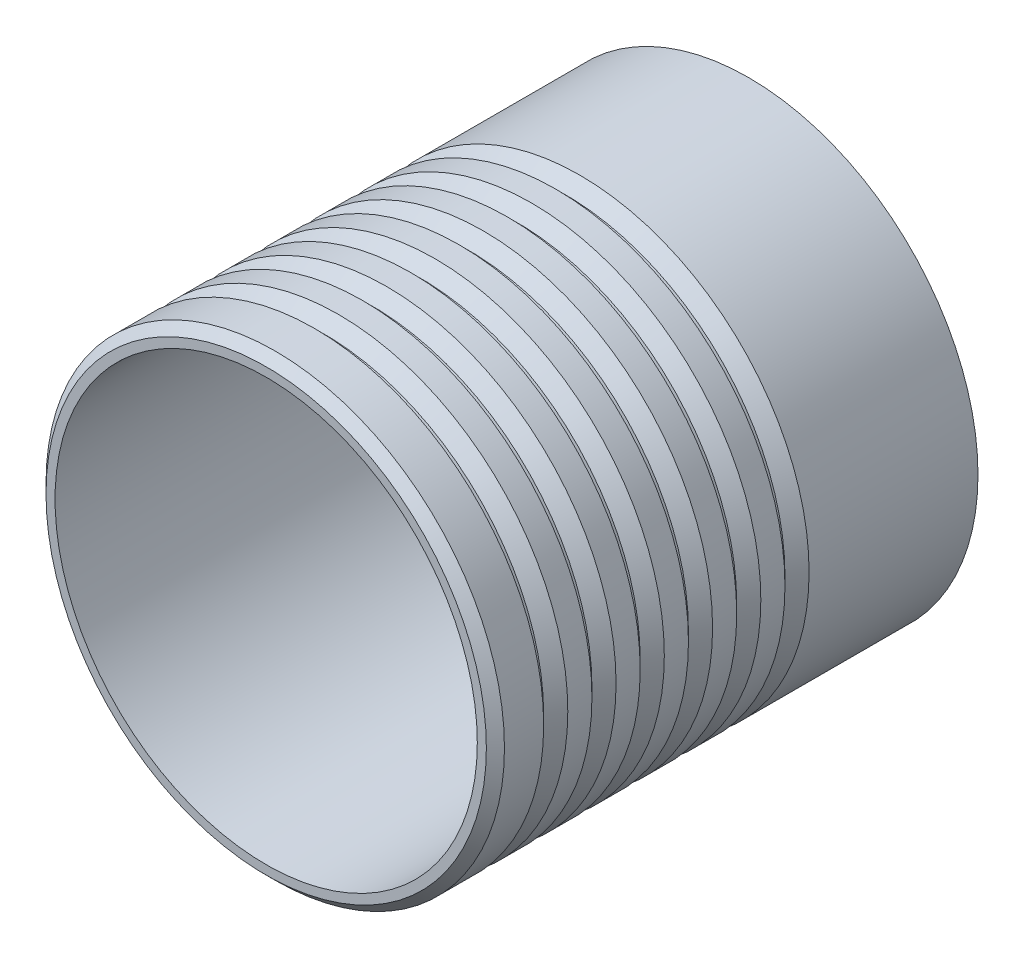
ISO-10303-21;
HEADER;
FILE_DESCRIPTION(('STEP AP214'),'2;1');
FILE_NAME('part.step','',(''),(''),'','','');
FILE_SCHEMA(('AUTOMOTIVE_DESIGN { 1 0 10303 214 1 1 1 1 }'));
ENDSEC;
DATA;
#1=APPLICATION_CONTEXT('core data for automotive mechanical design processes');
#2=APPLICATION_PROTOCOL_DEFINITION('international standard','automotive_design',2000,#1);
#3=PRODUCT_CONTEXT('',#1,'mechanical');
#4=PRODUCT('Part','Part','',(#3));
#5=PRODUCT_RELATED_PRODUCT_CATEGORY('part','',(#4));
#6=PRODUCT_DEFINITION_FORMATION('','',#4);
#7=PRODUCT_DEFINITION_CONTEXT('part definition',#1,'design');
#8=PRODUCT_DEFINITION('design','',#6,#7);
#9=PRODUCT_DEFINITION_SHAPE('','',#8);
#10=(LENGTH_UNIT() NAMED_UNIT(*) SI_UNIT(.MILLI.,.METRE.));
#11=(NAMED_UNIT(*) PLANE_ANGLE_UNIT() SI_UNIT($,.RADIAN.));
#12=(NAMED_UNIT(*) SI_UNIT($,.STERADIAN.) SOLID_ANGLE_UNIT());
#13=UNCERTAINTY_MEASURE_WITH_UNIT(LENGTH_MEASURE(1.E-05),#10,'distance_accuracy_value','');
#14=(GEOMETRIC_REPRESENTATION_CONTEXT(3) GLOBAL_UNCERTAINTY_ASSIGNED_CONTEXT((#13)) GLOBAL_UNIT_ASSIGNED_CONTEXT((#10,
#11,#12)) REPRESENTATION_CONTEXT('',''));
#15=CARTESIAN_POINT('',(0.,0.,0.));
#16=DIRECTION('',(0.,0.,1.));
#17=DIRECTION('',(1.,0.,0.));
#18=AXIS2_PLACEMENT_3D('',#15,#16,#17);
#19=CARTESIAN_POINT('',(0.,0.,80.));
#20=DIRECTION('',(0.,0.,-1.));
#21=DIRECTION('',(-1.,0.,0.));
#22=AXIS2_PLACEMENT_3D('',#19,#20,#21);
#23=CYLINDRICAL_SURFACE('',#22,38.);
#24=CARTESIAN_POINT('',(0.,0.,36.));
#25=DIRECTION('',(0.,0.,1.));
#26=DIRECTION('',(1.,0.,0.));
#27=AXIS2_PLACEMENT_3D('',#24,#25,#26);
#28=CIRCLE('',#27,38.);
#29=CARTESIAN_POINT('',(38.,0.,36.));
#30=VERTEX_POINT('',#29);
#31=EDGE_CURVE('E104',#30,#30,#28,.T.);
#32=ORIENTED_EDGE('',*,*,#31,.F.);
#33=EDGE_LOOP('',(#32));
#34=FACE_BOUND('',#33,.T.);
#35=CARTESIAN_POINT('',(0.,0.,32.));
#36=DIRECTION('',(0.,0.,1.));
#37=DIRECTION('',(1.,0.,0.));
#38=AXIS2_PLACEMENT_3D('',#35,#36,#37);
#39=CIRCLE('',#38,38.);
#40=CARTESIAN_POINT('',(38.,0.,32.));
#41=VERTEX_POINT('',#40);
#42=EDGE_CURVE('E113',#41,#41,#39,.T.);
#43=ORIENTED_EDGE('',*,*,#42,.T.);
#44=EDGE_LOOP('',(#43));
#45=FACE_BOUND('',#44,.T.);
#46=ADVANCED_FACE('F30',(#34,#45),#23,.T.);
#47=CARTESIAN_POINT('',(0.,0.,0.));
#48=DIRECTION('',(0.,0.,1.));
#49=DIRECTION('',(1.,0.,0.));
#50=AXIS2_PLACEMENT_3D('',#47,#48,#49);
#51=CIRCLE('',#50,38.);
#52=CARTESIAN_POINT('',(38.,0.,0.));
#53=VERTEX_POINT('',#52);
#54=EDGE_CURVE('E41',#53,#53,#51,.T.);
#55=ORIENTED_EDGE('',*,*,#54,.T.);
#56=EDGE_LOOP('',(#55));
#57=FACE_BOUND('',#56,.T.);
#58=CARTESIAN_POINT('',(0.,0.,28.));
#59=DIRECTION('',(0.,0.,1.));
#60=DIRECTION('',(1.,0.,0.));
#61=AXIS2_PLACEMENT_3D('',#58,#59,#60);
#62=CIRCLE('',#61,38.);
#63=CARTESIAN_POINT('',(38.,0.,28.));
#64=VERTEX_POINT('',#63);
#65=EDGE_CURVE('E116',#64,#64,#62,.T.);
#66=ORIENTED_EDGE('',*,*,#65,.F.);
#67=EDGE_LOOP('',(#66));
#68=FACE_BOUND('',#67,.T.);
#69=ADVANCED_FACE('F142',(#57,#68),#23,.T.);
#70=CARTESIAN_POINT('',(0.,0.,44.));
#71=DIRECTION('',(0.,0.,1.));
#72=DIRECTION('',(1.,0.,0.));
#73=AXIS2_PLACEMENT_3D('',#70,#71,#72);
#74=CIRCLE('',#73,38.);
#75=CARTESIAN_POINT('',(38.,0.,44.));
#76=VERTEX_POINT('',#75);
#77=EDGE_CURVE('E92',#76,#76,#74,.T.);
#78=ORIENTED_EDGE('',*,*,#77,.F.);
#79=EDGE_LOOP('',(#78));
#80=FACE_BOUND('',#79,.T.);
#81=CARTESIAN_POINT('',(0.,0.,40.));
#82=DIRECTION('',(0.,0.,1.));
#83=DIRECTION('',(1.,0.,0.));
#84=AXIS2_PLACEMENT_3D('',#81,#82,#83);
#85=CIRCLE('',#84,38.);
#86=CARTESIAN_POINT('',(38.,0.,40.));
#87=VERTEX_POINT('',#86);
#88=EDGE_CURVE('E101',#87,#87,#85,.T.);
#89=ORIENTED_EDGE('',*,*,#88,.T.);
#90=EDGE_LOOP('',(#89));
#91=FACE_BOUND('',#90,.T.);
#92=ADVANCED_FACE('F148',(#80,#91),#23,.T.);
#93=CARTESIAN_POINT('',(0.,0.,52.));
#94=DIRECTION('',(0.,0.,1.));
#95=DIRECTION('',(1.,0.,0.));
#96=AXIS2_PLACEMENT_3D('',#93,#94,#95);
#97=CIRCLE('',#96,38.);
#98=CARTESIAN_POINT('',(38.,0.,52.));
#99=VERTEX_POINT('',#98);
#100=EDGE_CURVE('E80',#99,#99,#97,.T.);
#101=ORIENTED_EDGE('',*,*,#100,.F.);
#102=EDGE_LOOP('',(#101));
#103=FACE_BOUND('',#102,.T.);
#104=CARTESIAN_POINT('',(0.,0.,48.));
#105=DIRECTION('',(0.,0.,1.));
#106=DIRECTION('',(1.,0.,0.));
#107=AXIS2_PLACEMENT_3D('',#104,#105,#106);
#108=CIRCLE('',#107,38.);
#109=CARTESIAN_POINT('',(38.,0.,48.));
#110=VERTEX_POINT('',#109);
#111=EDGE_CURVE('E89',#110,#110,#108,.T.);
#112=ORIENTED_EDGE('',*,*,#111,.T.);
#113=EDGE_LOOP('',(#112));
#114=FACE_BOUND('',#113,.T.);
#115=ADVANCED_FACE('F243',(#103,#114),#23,.T.);
#116=CARTESIAN_POINT('',(0.,0.,60.));
#117=DIRECTION('',(0.,0.,1.));
#118=DIRECTION('',(1.,0.,0.));
#119=AXIS2_PLACEMENT_3D('',#116,#117,#118);
#120=CIRCLE('',#119,38.);
#121=CARTESIAN_POINT('',(38.,0.,60.));
#122=VERTEX_POINT('',#121);
#123=EDGE_CURVE('E68',#122,#122,#120,.T.);
#124=ORIENTED_EDGE('',*,*,#123,.F.);
#125=EDGE_LOOP('',(#124));
#126=FACE_BOUND('',#125,.T.);
#127=CARTESIAN_POINT('',(0.,0.,56.));
#128=DIRECTION('',(0.,0.,1.));
#129=DIRECTION('',(1.,0.,0.));
#130=AXIS2_PLACEMENT_3D('',#127,#128,#129);
#131=CIRCLE('',#130,38.);
#132=CARTESIAN_POINT('',(38.,0.,56.));
#133=VERTEX_POINT('',#132);
#134=EDGE_CURVE('E77',#133,#133,#131,.T.);
#135=ORIENTED_EDGE('',*,*,#134,.T.);
#136=EDGE_LOOP('',(#135));
#137=FACE_BOUND('',#136,.T.);
#138=ADVANCED_FACE('F162',(#126,#137),#23,.T.);
#139=CARTESIAN_POINT('',(0.,0.,68.));
#140=DIRECTION('',(0.,0.,1.));
#141=DIRECTION('',(1.,0.,0.));
#142=AXIS2_PLACEMENT_3D('',#139,#140,#141);
#143=CIRCLE('',#142,38.);
#144=CARTESIAN_POINT('',(38.,0.,68.));
#145=VERTEX_POINT('',#144);
#146=EDGE_CURVE('E56',#145,#145,#143,.T.);
#147=ORIENTED_EDGE('',*,*,#146,.F.);
#148=EDGE_LOOP('',(#147));
#149=FACE_BOUND('',#148,.T.);
#150=CARTESIAN_POINT('',(0.,0.,64.));
#151=DIRECTION('',(0.,0.,1.));
#152=DIRECTION('',(1.,0.,0.));
#153=AXIS2_PLACEMENT_3D('',#150,#151,#152);
#154=CIRCLE('',#153,38.);
#155=CARTESIAN_POINT('',(38.,0.,64.));
#156=VERTEX_POINT('',#155);
#157=EDGE_CURVE('E65',#156,#156,#154,.T.);
#158=ORIENTED_EDGE('',*,*,#157,.T.);
#159=EDGE_LOOP('',(#158));
#160=FACE_BOUND('',#159,.T.);
#161=ADVANCED_FACE('F155',(#149,#160),#23,.T.);
#162=CARTESIAN_POINT('',(0.,0.,78.5));
#163=DIRECTION('',(0.,0.,1.));
#164=DIRECTION('',(1.,0.,0.));
#165=AXIS2_PLACEMENT_3D('',#162,#163,#164);
#166=CIRCLE('',#165,38.);
#167=CARTESIAN_POINT('',(38.,0.,78.5));
#168=VERTEX_POINT('',#167);
#169=EDGE_CURVE('E10',#168,#168,#166,.F.);
#170=ORIENTED_EDGE('',*,*,#169,.T.);
#171=EDGE_LOOP('',(#170));
#172=FACE_BOUND('',#171,.T.);
#173=CARTESIAN_POINT('',(0.,0.,72.));
#174=DIRECTION('',(0.,0.,1.));
#175=DIRECTION('',(1.,0.,0.));
#176=AXIS2_PLACEMENT_3D('',#173,#174,#175);
#177=CIRCLE('',#176,38.);
#178=CARTESIAN_POINT('',(38.,0.,72.));
#179=VERTEX_POINT('',#178);
#180=EDGE_CURVE('E51',#179,#179,#177,.T.);
#181=ORIENTED_EDGE('',*,*,#180,.T.);
#182=EDGE_LOOP('',(#181));
#183=FACE_BOUND('',#182,.T.);
#184=ADVANCED_FACE('F144',(#172,#183),#23,.T.);
#185=CARTESIAN_POINT('',(0.,0.,80.));
#186=DIRECTION('',(0.,0.,1.));
#187=DIRECTION('',(1.,0.,0.));
#188=AXIS2_PLACEMENT_3D('',#185,#186,#187);
#189=PLANE('',#188);
#190=CARTESIAN_POINT('',(0.,0.,80.));
#191=DIRECTION('',(0.,0.,1.));
#192=DIRECTION('',(1.,0.,0.));
#193=AXIS2_PLACEMENT_3D('',#190,#191,#192);
#194=CIRCLE('',#193,36.5);
#195=CARTESIAN_POINT('',(36.5,0.,80.));
#196=VERTEX_POINT('',#195);
#197=EDGE_CURVE('E37',#196,#196,#194,.T.);
#198=ORIENTED_EDGE('',*,*,#197,.T.);
#199=EDGE_LOOP('',(#198));
#200=FACE_BOUND('',#199,.T.);
#201=CARTESIAN_POINT('',(0.,0.,80.));
#202=DIRECTION('',(0.,0.,1.));
#203=DIRECTION('',(1.,0.,0.));
#204=AXIS2_PLACEMENT_3D('',#201,#202,#203);
#205=CIRCLE('',#204,35.);
#206=CARTESIAN_POINT('',(35.,0.,80.));
#207=VERTEX_POINT('',#206);
#208=EDGE_CURVE('E45',#207,#207,#205,.T.);
#209=ORIENTED_EDGE('',*,*,#208,.F.);
#210=EDGE_LOOP('',(#209));
#211=FACE_BOUND('',#210,.T.);
#212=ADVANCED_FACE('F154',(#200,#211),#189,.T.);
#213=CARTESIAN_POINT('',(0.,0.,0.));
#214=DIRECTION('',(0.,0.,1.));
#215=DIRECTION('',(1.,0.,0.));
#216=AXIS2_PLACEMENT_3D('',#213,#214,#215);
#217=PLANE('',#216);
#218=ORIENTED_EDGE('',*,*,#54,.F.);
#219=EDGE_LOOP('',(#218));
#220=FACE_BOUND('',#219,.T.);
#221=CARTESIAN_POINT('',(0.,0.,0.));
#222=DIRECTION('',(0.,0.,1.));
#223=DIRECTION('',(1.,0.,0.));
#224=AXIS2_PLACEMENT_3D('',#221,#222,#223);
#225=CIRCLE('',#224,35.);
#226=CARTESIAN_POINT('',(35.,0.,0.));
#227=VERTEX_POINT('',#226);
#228=EDGE_CURVE('E48',#227,#227,#225,.T.);
#229=ORIENTED_EDGE('',*,*,#228,.T.);
#230=EDGE_LOOP('',(#229));
#231=FACE_BOUND('',#230,.T.);
#232=ADVANCED_FACE('F160',(#220,#231),#217,.F.);
#233=CARTESIAN_POINT('',(0.,0.,80.));
#234=DIRECTION('',(0.,0.,-1.));
#235=DIRECTION('',(-1.,0.,0.));
#236=AXIS2_PLACEMENT_3D('',#233,#234,#235);
#237=CYLINDRICAL_SURFACE('',#236,35.);
#238=ORIENTED_EDGE('',*,*,#208,.T.);
#239=EDGE_LOOP('',(#238));
#240=FACE_BOUND('',#239,.T.);
#241=ORIENTED_EDGE('',*,*,#228,.F.);
#242=EDGE_LOOP('',(#241));
#243=FACE_BOUND('',#242,.T.);
#244=ADVANCED_FACE('F170',(#240,#243),#237,.F.);
#245=CARTESIAN_POINT('',(0.,36.5,72.));
#246=DIRECTION('',(0.,0.,-1.));
#247=DIRECTION('',(-1.,0.,0.));
#248=AXIS2_PLACEMENT_3D('',#245,#246,#247);
#249=PLANE('',#248);
#250=CARTESIAN_POINT('',(0.,0.,72.));
#251=DIRECTION('',(0.,0.,1.));
#252=DIRECTION('',(1.,0.,0.));
#253=AXIS2_PLACEMENT_3D('',#250,#251,#252);
#254=CIRCLE('',#253,36.5);
#255=CARTESIAN_POINT('',(36.5,0.,72.));
#256=VERTEX_POINT('',#255);
#257=EDGE_CURVE('E62',#256,#256,#254,.T.);
#258=ORIENTED_EDGE('',*,*,#257,.T.);
#259=EDGE_LOOP('',(#258));
#260=FACE_BOUND('',#259,.T.);
#261=ORIENTED_EDGE('',*,*,#180,.F.);
#262=EDGE_LOOP('',(#261));
#263=FACE_BOUND('',#262,.T.);
#264=ADVANCED_FACE('F167',(#260,#263),#249,.T.);
#265=CARTESIAN_POINT('',(0.,0.,70.5));
#266=DIRECTION('',(0.,0.,-1.));
#267=DIRECTION('',(-1.,0.,0.));
#268=AXIS2_PLACEMENT_3D('',#265,#266,#267);
#269=CONICAL_SURFACE('',#268,36.5,0.540419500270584);
#270=ORIENTED_EDGE('',*,*,#146,.T.);
#271=EDGE_LOOP('',(#270));
#272=FACE_BOUND('',#271,.T.);
#273=CARTESIAN_POINT('',(0.,0.,70.5));
#274=DIRECTION('',(0.,0.,1.));
#275=DIRECTION('',(1.,0.,0.));
#276=AXIS2_PLACEMENT_3D('',#273,#274,#275);
#277=CIRCLE('',#276,36.5);
#278=CARTESIAN_POINT('',(36.5,0.,70.5));
#279=VERTEX_POINT('',#278);
#280=EDGE_CURVE('E59',#279,#279,#277,.T.);
#281=ORIENTED_EDGE('',*,*,#280,.F.);
#282=EDGE_LOOP('',(#281));
#283=FACE_BOUND('',#282,.T.);
#284=ADVANCED_FACE('F169',(#272,#283),#269,.T.);
#285=CARTESIAN_POINT('',(0.,0.,80.));
#286=DIRECTION('',(0.,0.,1.));
#287=DIRECTION('',(1.,0.,0.));
#288=AXIS2_PLACEMENT_3D('',#285,#286,#287);
#289=CYLINDRICAL_SURFACE('',#288,36.5);
#290=ORIENTED_EDGE('',*,*,#280,.T.);
#291=EDGE_LOOP('',(#290));
#292=FACE_BOUND('',#291,.T.);
#293=ORIENTED_EDGE('',*,*,#257,.F.);
#294=EDGE_LOOP('',(#293));
#295=FACE_BOUND('',#294,.T.);
#296=ADVANCED_FACE('F177',(#292,#295),#289,.T.);
#297=CARTESIAN_POINT('',(0.,36.5,64.));
#298=DIRECTION('',(0.,0.,-1.));
#299=DIRECTION('',(-1.,0.,0.));
#300=AXIS2_PLACEMENT_3D('',#297,#298,#299);
#301=PLANE('',#300);
#302=CARTESIAN_POINT('',(0.,0.,64.));
#303=DIRECTION('',(0.,0.,1.));
#304=DIRECTION('',(1.,0.,0.));
#305=AXIS2_PLACEMENT_3D('',#302,#303,#304);
#306=CIRCLE('',#305,36.5);
#307=CARTESIAN_POINT('',(36.5,0.,64.));
#308=VERTEX_POINT('',#307);
#309=EDGE_CURVE('E74',#308,#308,#306,.T.);
#310=ORIENTED_EDGE('',*,*,#309,.T.);
#311=EDGE_LOOP('',(#310));
#312=FACE_BOUND('',#311,.T.);
#313=ORIENTED_EDGE('',*,*,#157,.F.);
#314=EDGE_LOOP('',(#313));
#315=FACE_BOUND('',#314,.T.);
#316=ADVANCED_FACE('F220',(#312,#315),#301,.T.);
#317=CARTESIAN_POINT('',(0.,0.,62.5));
#318=DIRECTION('',(0.,0.,-1.));
#319=DIRECTION('',(-1.,0.,0.));
#320=AXIS2_PLACEMENT_3D('',#317,#318,#319);
#321=CONICAL_SURFACE('',#320,36.5,0.540419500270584);
#322=ORIENTED_EDGE('',*,*,#123,.T.);
#323=EDGE_LOOP('',(#322));
#324=FACE_BOUND('',#323,.T.);
#325=CARTESIAN_POINT('',(0.,0.,62.5));
#326=DIRECTION('',(0.,0.,1.));
#327=DIRECTION('',(1.,0.,0.));
#328=AXIS2_PLACEMENT_3D('',#325,#326,#327);
#329=CIRCLE('',#328,36.5);
#330=CARTESIAN_POINT('',(36.5,0.,62.5));
#331=VERTEX_POINT('',#330);
#332=EDGE_CURVE('E71',#331,#331,#329,.T.);
#333=ORIENTED_EDGE('',*,*,#332,.F.);
#334=EDGE_LOOP('',(#333));
#335=FACE_BOUND('',#334,.T.);
#336=ADVANCED_FACE('F271',(#324,#335),#321,.T.);
#337=CARTESIAN_POINT('',(0.,0.,72.));
#338=DIRECTION('',(0.,0.,1.));
#339=DIRECTION('',(1.,0.,0.));
#340=AXIS2_PLACEMENT_3D('',#337,#338,#339);
#341=CYLINDRICAL_SURFACE('',#340,36.5);
#342=ORIENTED_EDGE('',*,*,#332,.T.);
#343=EDGE_LOOP('',(#342));
#344=FACE_BOUND('',#343,.T.);
#345=ORIENTED_EDGE('',*,*,#309,.F.);
#346=EDGE_LOOP('',(#345));
#347=FACE_BOUND('',#346,.T.);
#348=ADVANCED_FACE('F281',(#344,#347),#341,.T.);
#349=CARTESIAN_POINT('',(0.,36.5,56.));
#350=DIRECTION('',(0.,0.,-1.));
#351=DIRECTION('',(-1.,0.,0.));
#352=AXIS2_PLACEMENT_3D('',#349,#350,#351);
#353=PLANE('',#352);
#354=CARTESIAN_POINT('',(0.,0.,56.));
#355=DIRECTION('',(0.,0.,1.));
#356=DIRECTION('',(1.,0.,0.));
#357=AXIS2_PLACEMENT_3D('',#354,#355,#356);
#358=CIRCLE('',#357,36.5);
#359=CARTESIAN_POINT('',(36.5,0.,56.));
#360=VERTEX_POINT('',#359);
#361=EDGE_CURVE('E86',#360,#360,#358,.T.);
#362=ORIENTED_EDGE('',*,*,#361,.T.);
#363=EDGE_LOOP('',(#362));
#364=FACE_BOUND('',#363,.T.);
#365=ORIENTED_EDGE('',*,*,#134,.F.);
#366=EDGE_LOOP('',(#365));
#367=FACE_BOUND('',#366,.T.);
#368=ADVANCED_FACE('F291',(#364,#367),#353,.T.);
#369=CARTESIAN_POINT('',(0.,0.,54.5));
#370=DIRECTION('',(0.,0.,-1.));
#371=DIRECTION('',(-1.,0.,0.));
#372=AXIS2_PLACEMENT_3D('',#369,#370,#371);
#373=CONICAL_SURFACE('',#372,36.5,0.540419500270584);
#374=ORIENTED_EDGE('',*,*,#100,.T.);
#375=EDGE_LOOP('',(#374));
#376=FACE_BOUND('',#375,.T.);
#377=CARTESIAN_POINT('',(0.,0.,54.5));
#378=DIRECTION('',(0.,0.,1.));
#379=DIRECTION('',(1.,0.,0.));
#380=AXIS2_PLACEMENT_3D('',#377,#378,#379);
#381=CIRCLE('',#380,36.5);
#382=CARTESIAN_POINT('',(36.5,0.,54.5));
#383=VERTEX_POINT('',#382);
#384=EDGE_CURVE('E83',#383,#383,#381,.T.);
#385=ORIENTED_EDGE('',*,*,#384,.F.);
#386=EDGE_LOOP('',(#385));
#387=FACE_BOUND('',#386,.T.);
#388=ADVANCED_FACE('F301',(#376,#387),#373,.T.);
#389=CARTESIAN_POINT('',(0.,0.,64.));
#390=DIRECTION('',(0.,0.,1.));
#391=DIRECTION('',(1.,0.,0.));
#392=AXIS2_PLACEMENT_3D('',#389,#390,#391);
#393=CYLINDRICAL_SURFACE('',#392,36.5);
#394=ORIENTED_EDGE('',*,*,#384,.T.);
#395=EDGE_LOOP('',(#394));
#396=FACE_BOUND('',#395,.T.);
#397=ORIENTED_EDGE('',*,*,#361,.F.);
#398=EDGE_LOOP('',(#397));
#399=FACE_BOUND('',#398,.T.);
#400=ADVANCED_FACE('F311',(#396,#399),#393,.T.);
#401=CARTESIAN_POINT('',(0.,36.5,48.));
#402=DIRECTION('',(0.,0.,-1.));
#403=DIRECTION('',(-1.,0.,0.));
#404=AXIS2_PLACEMENT_3D('',#401,#402,#403);
#405=PLANE('',#404);
#406=CARTESIAN_POINT('',(0.,0.,48.));
#407=DIRECTION('',(0.,0.,1.));
#408=DIRECTION('',(1.,0.,0.));
#409=AXIS2_PLACEMENT_3D('',#406,#407,#408);
#410=CIRCLE('',#409,36.5);
#411=CARTESIAN_POINT('',(36.5,0.,48.));
#412=VERTEX_POINT('',#411);
#413=EDGE_CURVE('E98',#412,#412,#410,.T.);
#414=ORIENTED_EDGE('',*,*,#413,.T.);
#415=EDGE_LOOP('',(#414));
#416=FACE_BOUND('',#415,.T.);
#417=ORIENTED_EDGE('',*,*,#111,.F.);
#418=EDGE_LOOP('',(#417));
#419=FACE_BOUND('',#418,.T.);
#420=ADVANCED_FACE('F321',(#416,#419),#405,.T.);
#421=CARTESIAN_POINT('',(0.,0.,46.5));
#422=DIRECTION('',(0.,0.,-1.));
#423=DIRECTION('',(-1.,0.,0.));
#424=AXIS2_PLACEMENT_3D('',#421,#422,#423);
#425=CONICAL_SURFACE('',#424,36.5,0.540419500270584);
#426=ORIENTED_EDGE('',*,*,#77,.T.);
#427=EDGE_LOOP('',(#426));
#428=FACE_BOUND('',#427,.T.);
#429=CARTESIAN_POINT('',(0.,0.,46.5));
#430=DIRECTION('',(0.,0.,1.));
#431=DIRECTION('',(1.,0.,0.));
#432=AXIS2_PLACEMENT_3D('',#429,#430,#431);
#433=CIRCLE('',#432,36.5);
#434=CARTESIAN_POINT('',(36.5,0.,46.5));
#435=VERTEX_POINT('',#434);
#436=EDGE_CURVE('E95',#435,#435,#433,.T.);
#437=ORIENTED_EDGE('',*,*,#436,.F.);
#438=EDGE_LOOP('',(#437));
#439=FACE_BOUND('',#438,.T.);
#440=ADVANCED_FACE('F331',(#428,#439),#425,.T.);
#441=CARTESIAN_POINT('',(0.,0.,56.));
#442=DIRECTION('',(0.,0.,1.));
#443=DIRECTION('',(1.,0.,0.));
#444=AXIS2_PLACEMENT_3D('',#441,#442,#443);
#445=CYLINDRICAL_SURFACE('',#444,36.5);
#446=ORIENTED_EDGE('',*,*,#436,.T.);
#447=EDGE_LOOP('',(#446));
#448=FACE_BOUND('',#447,.T.);
#449=ORIENTED_EDGE('',*,*,#413,.F.);
#450=EDGE_LOOP('',(#449));
#451=FACE_BOUND('',#450,.T.);
#452=ADVANCED_FACE('F341',(#448,#451),#445,.T.);
#453=CARTESIAN_POINT('',(0.,36.5,40.));
#454=DIRECTION('',(0.,0.,-1.));
#455=DIRECTION('',(-1.,0.,0.));
#456=AXIS2_PLACEMENT_3D('',#453,#454,#455);
#457=PLANE('',#456);
#458=CARTESIAN_POINT('',(0.,0.,40.));
#459=DIRECTION('',(0.,0.,1.));
#460=DIRECTION('',(1.,0.,0.));
#461=AXIS2_PLACEMENT_3D('',#458,#459,#460);
#462=CIRCLE('',#461,36.5);
#463=CARTESIAN_POINT('',(36.5,0.,40.));
#464=VERTEX_POINT('',#463);
#465=EDGE_CURVE('E110',#464,#464,#462,.T.);
#466=ORIENTED_EDGE('',*,*,#465,.T.);
#467=EDGE_LOOP('',(#466));
#468=FACE_BOUND('',#467,.T.);
#469=ORIENTED_EDGE('',*,*,#88,.F.);
#470=EDGE_LOOP('',(#469));
#471=FACE_BOUND('',#470,.T.);
#472=ADVANCED_FACE('F351',(#468,#471),#457,.T.);
#473=CARTESIAN_POINT('',(0.,0.,38.5));
#474=DIRECTION('',(0.,0.,-1.));
#475=DIRECTION('',(-1.,0.,0.));
#476=AXIS2_PLACEMENT_3D('',#473,#474,#475);
#477=CONICAL_SURFACE('',#476,36.5,0.540419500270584);
#478=ORIENTED_EDGE('',*,*,#31,.T.);
#479=EDGE_LOOP('',(#478));
#480=FACE_BOUND('',#479,.T.);
#481=CARTESIAN_POINT('',(0.,0.,38.5));
#482=DIRECTION('',(0.,0.,1.));
#483=DIRECTION('',(1.,0.,0.));
#484=AXIS2_PLACEMENT_3D('',#481,#482,#483);
#485=CIRCLE('',#484,36.5);
#486=CARTESIAN_POINT('',(36.5,0.,38.5));
#487=VERTEX_POINT('',#486);
#488=EDGE_CURVE('E107',#487,#487,#485,.T.);
#489=ORIENTED_EDGE('',*,*,#488,.F.);
#490=EDGE_LOOP('',(#489));
#491=FACE_BOUND('',#490,.T.);
#492=ADVANCED_FACE('F361',(#480,#491),#477,.T.);
#493=CARTESIAN_POINT('',(0.,0.,48.));
#494=DIRECTION('',(0.,0.,1.));
#495=DIRECTION('',(1.,0.,0.));
#496=AXIS2_PLACEMENT_3D('',#493,#494,#495);
#497=CYLINDRICAL_SURFACE('',#496,36.5);
#498=ORIENTED_EDGE('',*,*,#488,.T.);
#499=EDGE_LOOP('',(#498));
#500=FACE_BOUND('',#499,.T.);
#501=ORIENTED_EDGE('',*,*,#465,.F.);
#502=EDGE_LOOP('',(#501));
#503=FACE_BOUND('',#502,.T.);
#504=ADVANCED_FACE('F371',(#500,#503),#497,.T.);
#505=CARTESIAN_POINT('',(0.,36.5,32.));
#506=DIRECTION('',(0.,0.,-1.));
#507=DIRECTION('',(-1.,0.,0.));
#508=AXIS2_PLACEMENT_3D('',#505,#506,#507);
#509=PLANE('',#508);
#510=CARTESIAN_POINT('',(0.,0.,32.));
#511=DIRECTION('',(0.,0.,1.));
#512=DIRECTION('',(1.,0.,0.));
#513=AXIS2_PLACEMENT_3D('',#510,#511,#512);
#514=CIRCLE('',#513,36.5);
#515=CARTESIAN_POINT('',(36.5,0.,32.));
#516=VERTEX_POINT('',#515);
#517=EDGE_CURVE('E122',#516,#516,#514,.T.);
#518=ORIENTED_EDGE('',*,*,#517,.T.);
#519=EDGE_LOOP('',(#518));
#520=FACE_BOUND('',#519,.T.);
#521=ORIENTED_EDGE('',*,*,#42,.F.);
#522=EDGE_LOOP('',(#521));
#523=FACE_BOUND('',#522,.T.);
#524=ADVANCED_FACE('F126',(#520,#523),#509,.T.);
#525=CARTESIAN_POINT('',(0.,0.,30.5));
#526=DIRECTION('',(0.,0.,-1.));
#527=DIRECTION('',(-1.,0.,0.));
#528=AXIS2_PLACEMENT_3D('',#525,#526,#527);
#529=CONICAL_SURFACE('',#528,36.5,0.540419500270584);
#530=ORIENTED_EDGE('',*,*,#65,.T.);
#531=EDGE_LOOP('',(#530));
#532=FACE_BOUND('',#531,.T.);
#533=CARTESIAN_POINT('',(0.,0.,30.5));
#534=DIRECTION('',(0.,0.,1.));
#535=DIRECTION('',(1.,0.,0.));
#536=AXIS2_PLACEMENT_3D('',#533,#534,#535);
#537=CIRCLE('',#536,36.5);
#538=CARTESIAN_POINT('',(36.5,0.,30.5));
#539=VERTEX_POINT('',#538);
#540=EDGE_CURVE('E119',#539,#539,#537,.T.);
#541=ORIENTED_EDGE('',*,*,#540,.F.);
#542=EDGE_LOOP('',(#541));
#543=FACE_BOUND('',#542,.T.);
#544=ADVANCED_FACE('F131',(#532,#543),#529,.T.);
#545=CARTESIAN_POINT('',(0.,0.,40.));
#546=DIRECTION('',(0.,0.,1.));
#547=DIRECTION('',(1.,0.,0.));
#548=AXIS2_PLACEMENT_3D('',#545,#546,#547);
#549=CYLINDRICAL_SURFACE('',#548,36.5);
#550=ORIENTED_EDGE('',*,*,#540,.T.);
#551=EDGE_LOOP('',(#550));
#552=FACE_BOUND('',#551,.T.);
#553=ORIENTED_EDGE('',*,*,#517,.F.);
#554=EDGE_LOOP('',(#553));
#555=FACE_BOUND('',#554,.T.);
#556=ADVANCED_FACE('F129',(#552,#555),#549,.T.);
#557=CARTESIAN_POINT('',(0.,0.,80.));
#558=DIRECTION('',(0.,0.,-1.));
#559=DIRECTION('',(-1.,0.,0.));
#560=AXIS2_PLACEMENT_3D('',#557,#558,#559);
#561=CONICAL_SURFACE('',#560,36.5,0.785398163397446);
#562=ORIENTED_EDGE('',*,*,#169,.F.);
#563=EDGE_LOOP('',(#562));
#564=FACE_BOUND('',#563,.T.);
#565=ORIENTED_EDGE('',*,*,#197,.F.);
#566=EDGE_LOOP('',(#565));
#567=FACE_BOUND('',#566,.T.);
#568=ADVANCED_FACE('F32',(#564,#567),#561,.T.);
#569=CLOSED_SHELL('',(#46,#69,#92,#115,#138,#161,#184,#212,#232,#244,#264,#284,#296,#316,#336,
#348,#368,#388,#400,#420,#440,#452,#472,#492,#504,#524,#544,#556,#568));
#570=MANIFOLD_SOLID_BREP('B2',#569);
#571=ADVANCED_BREP_SHAPE_REPRESENTATION('',(#18,#570),#14);
#572=SHAPE_DEFINITION_REPRESENTATION(#9,#571);
ENDSEC;
END-ISO-10303-21;
